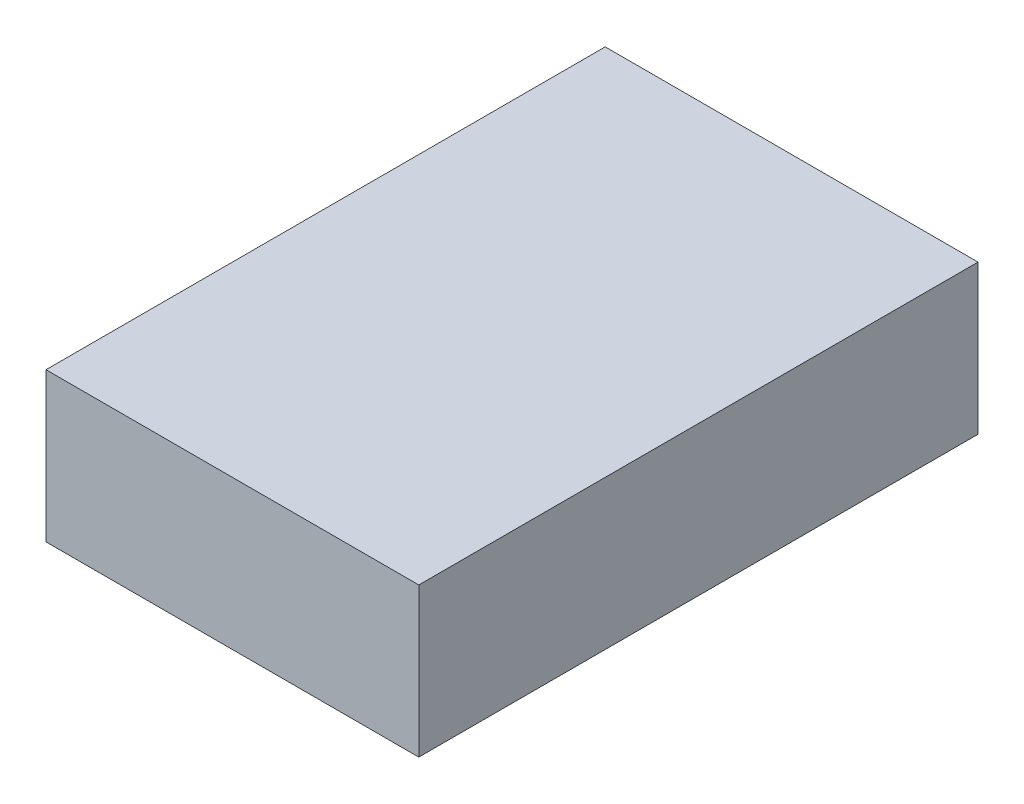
from build123d import *

# Parameters (mm, degrees)
SKETCH_1_W      = 20
SKETCH_1_H      = 8
EXTRUDE_1_DEPTH = 30


with BuildPart() as part:
    # Sketch 1 → Extrude 1 (new body)
    with BuildSketch(Plane.XY):
        Rectangle(SKETCH_1_W, SKETCH_1_H)
    extrude(amount=EXTRUDE_1_DEPTH)


solid = part.part
